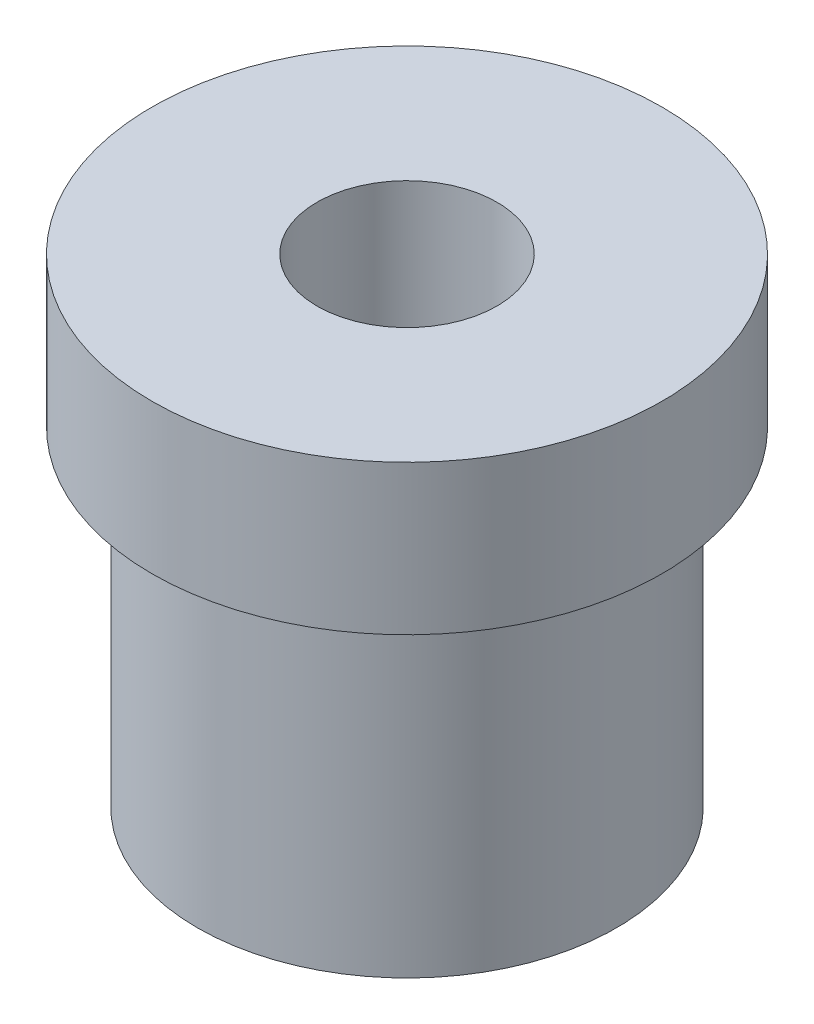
ISO-10303-21;
HEADER;
FILE_DESCRIPTION(('STEP AP214'),'2;1');
FILE_NAME('part.step','',(''),(''),'','','');
FILE_SCHEMA(('AUTOMOTIVE_DESIGN { 1 0 10303 214 1 1 1 1 }'));
ENDSEC;
DATA;
#1=APPLICATION_CONTEXT('core data for automotive mechanical design processes');
#2=APPLICATION_PROTOCOL_DEFINITION('international standard','automotive_design',2000,#1);
#3=PRODUCT_CONTEXT('',#1,'mechanical');
#4=PRODUCT('Part','Part','',(#3));
#5=PRODUCT_RELATED_PRODUCT_CATEGORY('part','',(#4));
#6=PRODUCT_DEFINITION_FORMATION('','',#4);
#7=PRODUCT_DEFINITION_CONTEXT('part definition',#1,'design');
#8=PRODUCT_DEFINITION('design','',#6,#7);
#9=PRODUCT_DEFINITION_SHAPE('','',#8);
#10=(LENGTH_UNIT() NAMED_UNIT(*) SI_UNIT(.MILLI.,.METRE.));
#11=(NAMED_UNIT(*) PLANE_ANGLE_UNIT() SI_UNIT($,.RADIAN.));
#12=(NAMED_UNIT(*) SI_UNIT($,.STERADIAN.) SOLID_ANGLE_UNIT());
#13=UNCERTAINTY_MEASURE_WITH_UNIT(LENGTH_MEASURE(1.E-05),#10,'distance_accuracy_value','');
#14=(GEOMETRIC_REPRESENTATION_CONTEXT(3) GLOBAL_UNCERTAINTY_ASSIGNED_CONTEXT((#13)) GLOBAL_UNIT_ASSIGNED_CONTEXT((#10,
#11,#12)) REPRESENTATION_CONTEXT('',''));
#15=CARTESIAN_POINT('',(0.,0.,0.));
#16=DIRECTION('',(0.,0.,1.));
#17=DIRECTION('',(1.,0.,0.));
#18=AXIS2_PLACEMENT_3D('',#15,#16,#17);
#19=CARTESIAN_POINT('',(0.,-12.7,0.));
#20=DIRECTION('',(0.,1.,0.));
#21=DIRECTION('',(0.,0.,1.));
#22=AXIS2_PLACEMENT_3D('',#19,#20,#21);
#23=CYLINDRICAL_SURFACE('',#22,5.55625);
#24=CARTESIAN_POINT('',(0.,-12.7,0.));
#25=DIRECTION('',(0.,1.,0.));
#26=DIRECTION('',(0.,0.,1.));
#27=AXIS2_PLACEMENT_3D('',#24,#25,#26);
#28=CIRCLE('',#27,5.55625);
#29=CARTESIAN_POINT('',(0.,-12.7,5.55625));
#30=VERTEX_POINT('',#29);
#31=EDGE_CURVE('E10',#30,#30,#28,.T.);
#32=ORIENTED_EDGE('',*,*,#31,.T.);
#33=EDGE_LOOP('',(#32));
#34=FACE_BOUND('',#33,.T.);
#35=CARTESIAN_POINT('',(0.,-3.9624,0.));
#36=DIRECTION('',(0.,1.,0.));
#37=DIRECTION('',(0.,0.,1.));
#38=AXIS2_PLACEMENT_3D('',#35,#36,#37);
#39=CIRCLE('',#38,5.55625);
#40=CARTESIAN_POINT('',(0.,-3.9624,5.55625));
#41=VERTEX_POINT('',#40);
#42=EDGE_CURVE('E29',#41,#41,#39,.F.);
#43=ORIENTED_EDGE('',*,*,#42,.T.);
#44=EDGE_LOOP('',(#43));
#45=FACE_BOUND('',#44,.T.);
#46=ADVANCED_FACE('F26',(#34,#45),#23,.T.);
#47=CARTESIAN_POINT('',(0.,-12.7,0.));
#48=DIRECTION('',(0.,1.,0.));
#49=DIRECTION('',(0.,0.,1.));
#50=AXIS2_PLACEMENT_3D('',#47,#48,#49);
#51=PLANE('',#50);
#52=CARTESIAN_POINT('',(0.,-12.7,0.));
#53=DIRECTION('',(0.,1.,0.));
#54=DIRECTION('',(0.,0.,1.));
#55=AXIS2_PLACEMENT_3D('',#52,#53,#54);
#56=CIRCLE('',#55,2.3876);
#57=CARTESIAN_POINT('',(0.,-12.7,2.3876));
#58=VERTEX_POINT('',#57);
#59=EDGE_CURVE('E43',#58,#58,#56,.T.);
#60=ORIENTED_EDGE('',*,*,#59,.T.);
#61=EDGE_LOOP('',(#60));
#62=FACE_BOUND('',#61,.T.);
#63=ORIENTED_EDGE('',*,*,#31,.F.);
#64=EDGE_LOOP('',(#63));
#65=FACE_BOUND('',#64,.T.);
#66=ADVANCED_FACE('F61',(#62,#65),#51,.F.);
#67=CARTESIAN_POINT('',(0.,-3.9624,0.));
#68=DIRECTION('',(0.,1.,0.));
#69=DIRECTION('',(0.,0.,1.));
#70=AXIS2_PLACEMENT_3D('',#67,#68,#69);
#71=CYLINDRICAL_SURFACE('',#70,6.76275);
#72=CARTESIAN_POINT('',(0.,-3.9624,0.));
#73=DIRECTION('',(0.,1.,0.));
#74=DIRECTION('',(0.,0.,1.));
#75=AXIS2_PLACEMENT_3D('',#72,#73,#74);
#76=CIRCLE('',#75,6.76275);
#77=CARTESIAN_POINT('',(0.,-3.9624,6.76275));
#78=VERTEX_POINT('',#77);
#79=EDGE_CURVE('E36',#78,#78,#76,.T.);
#80=ORIENTED_EDGE('',*,*,#79,.T.);
#81=EDGE_LOOP('',(#80));
#82=FACE_BOUND('',#81,.T.);
#83=CARTESIAN_POINT('',(0.,0.,0.));
#84=DIRECTION('',(0.,1.,0.));
#85=DIRECTION('',(0.,0.,1.));
#86=AXIS2_PLACEMENT_3D('',#83,#84,#85);
#87=CIRCLE('',#86,6.76275);
#88=CARTESIAN_POINT('',(0.,0.,6.76275));
#89=VERTEX_POINT('',#88);
#90=EDGE_CURVE('E40',#89,#89,#87,.T.);
#91=ORIENTED_EDGE('',*,*,#90,.F.);
#92=EDGE_LOOP('',(#91));
#93=FACE_BOUND('',#92,.T.);
#94=ADVANCED_FACE('F59',(#82,#93),#71,.T.);
#95=CARTESIAN_POINT('',(0.,-3.9624,0.));
#96=DIRECTION('',(0.,1.,0.));
#97=DIRECTION('',(0.,0.,1.));
#98=AXIS2_PLACEMENT_3D('',#95,#96,#97);
#99=PLANE('',#98);
#100=ORIENTED_EDGE('',*,*,#42,.F.);
#101=EDGE_LOOP('',(#100));
#102=FACE_BOUND('',#101,.T.);
#103=ORIENTED_EDGE('',*,*,#79,.F.);
#104=EDGE_LOOP('',(#103));
#105=FACE_BOUND('',#104,.T.);
#106=ADVANCED_FACE('F55',(#102,#105),#99,.F.);
#107=CARTESIAN_POINT('',(0.,0.,0.));
#108=DIRECTION('',(0.,1.,0.));
#109=DIRECTION('',(0.,0.,1.));
#110=AXIS2_PLACEMENT_3D('',#107,#108,#109);
#111=PLANE('',#110);
#112=CARTESIAN_POINT('',(0.,0.,0.));
#113=DIRECTION('',(0.,1.,0.));
#114=DIRECTION('',(0.,0.,1.));
#115=AXIS2_PLACEMENT_3D('',#112,#113,#114);
#116=CIRCLE('',#115,2.3876);
#117=CARTESIAN_POINT('',(0.,0.,2.3876));
#118=VERTEX_POINT('',#117);
#119=EDGE_CURVE('E46',#118,#118,#116,.T.);
#120=ORIENTED_EDGE('',*,*,#119,.F.);
#121=EDGE_LOOP('',(#120));
#122=FACE_BOUND('',#121,.T.);
#123=ORIENTED_EDGE('',*,*,#90,.T.);
#124=EDGE_LOOP('',(#123));
#125=FACE_BOUND('',#124,.T.);
#126=ADVANCED_FACE('F52',(#122,#125),#111,.T.);
#127=CARTESIAN_POINT('',(0.,-12.7,0.));
#128=DIRECTION('',(0.,1.,0.));
#129=DIRECTION('',(0.,0.,1.));
#130=AXIS2_PLACEMENT_3D('',#127,#128,#129);
#131=CYLINDRICAL_SURFACE('',#130,2.3876);
#132=ORIENTED_EDGE('',*,*,#59,.F.);
#133=EDGE_LOOP('',(#132));
#134=FACE_BOUND('',#133,.T.);
#135=ORIENTED_EDGE('',*,*,#119,.T.);
#136=EDGE_LOOP('',(#135));
#137=FACE_BOUND('',#136,.T.);
#138=ADVANCED_FACE('F50',(#134,#137),#131,.F.);
#139=CLOSED_SHELL('',(#46,#66,#94,#106,#126,#138));
#140=MANIFOLD_SOLID_BREP('B2',#139);
#141=ADVANCED_BREP_SHAPE_REPRESENTATION('',(#18,#140),#14);
#142=SHAPE_DEFINITION_REPRESENTATION(#9,#141);
ENDSEC;
END-ISO-10303-21;
